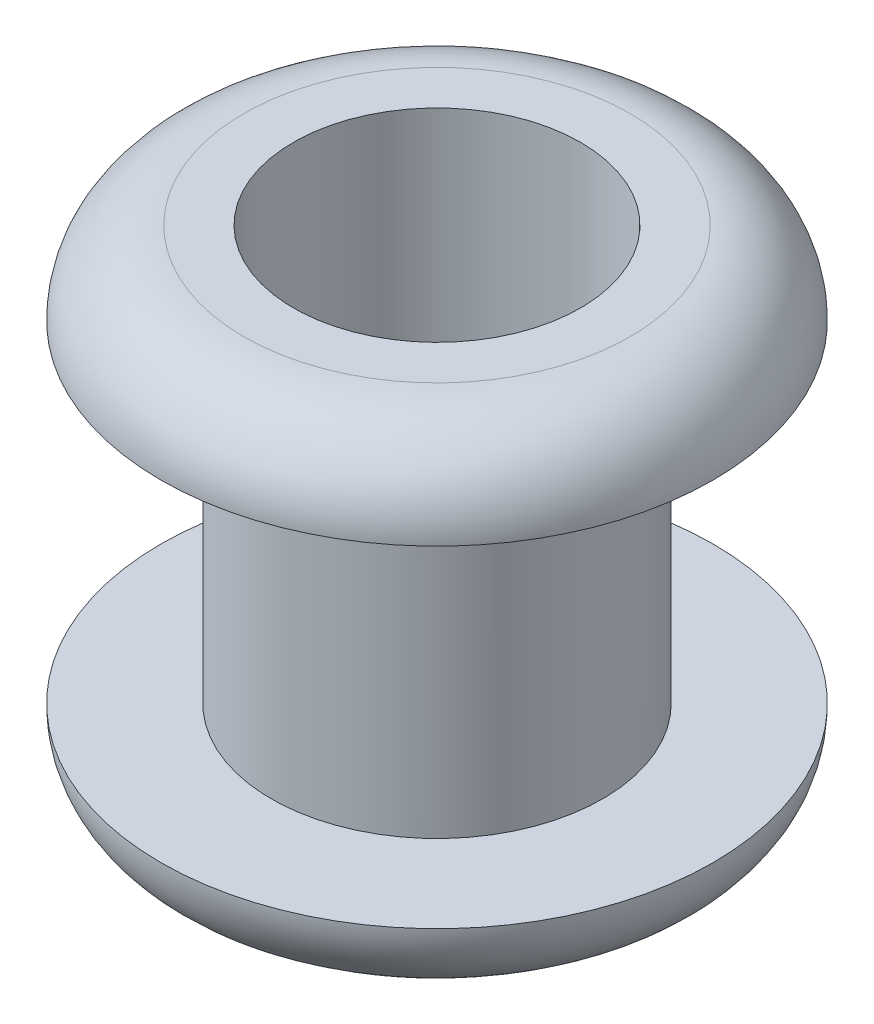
ISO-10303-21;
HEADER;
FILE_DESCRIPTION(('STEP AP214'),'2;1');
FILE_NAME('part.step','',(''),(''),'','','');
FILE_SCHEMA(('AUTOMOTIVE_DESIGN { 1 0 10303 214 1 1 1 1 }'));
ENDSEC;
DATA;
#1=APPLICATION_CONTEXT('core data for automotive mechanical design processes');
#2=APPLICATION_PROTOCOL_DEFINITION('international standard','automotive_design',2000,#1);
#3=PRODUCT_CONTEXT('',#1,'mechanical');
#4=PRODUCT('Part','Part','',(#3));
#5=PRODUCT_RELATED_PRODUCT_CATEGORY('part','',(#4));
#6=PRODUCT_DEFINITION_FORMATION('','',#4);
#7=PRODUCT_DEFINITION_CONTEXT('part definition',#1,'design');
#8=PRODUCT_DEFINITION('design','',#6,#7);
#9=PRODUCT_DEFINITION_SHAPE('','',#8);
#10=(LENGTH_UNIT() NAMED_UNIT(*) SI_UNIT(.MILLI.,.METRE.));
#11=(NAMED_UNIT(*) PLANE_ANGLE_UNIT() SI_UNIT($,.RADIAN.));
#12=(NAMED_UNIT(*) SI_UNIT($,.STERADIAN.) SOLID_ANGLE_UNIT());
#13=UNCERTAINTY_MEASURE_WITH_UNIT(LENGTH_MEASURE(1.E-05),#10,'distance_accuracy_value','');
#14=(GEOMETRIC_REPRESENTATION_CONTEXT(3) GLOBAL_UNCERTAINTY_ASSIGNED_CONTEXT((#13)) GLOBAL_UNIT_ASSIGNED_CONTEXT((#10,
#11,#12)) REPRESENTATION_CONTEXT('',''));
#15=CARTESIAN_POINT('',(0.,0.,0.));
#16=DIRECTION('',(0.,0.,1.));
#17=DIRECTION('',(1.,0.,0.));
#18=AXIS2_PLACEMENT_3D('',#15,#16,#17);
#19=CARTESIAN_POINT('',(0.,3.,0.));
#20=DIRECTION('',(0.,-1.,0.));
#21=DIRECTION('',(0.,0.,-1.));
#22=AXIS2_PLACEMENT_3D('',#19,#20,#21);
#23=CYLINDRICAL_SURFACE('',#22,1.5);
#24=CARTESIAN_POINT('',(0.,3.,0.));
#25=DIRECTION('',(0.,1.,0.));
#26=DIRECTION('',(0.,0.,1.));
#27=AXIS2_PLACEMENT_3D('',#24,#25,#26);
#28=CIRCLE('',#27,1.5);
#29=CARTESIAN_POINT('',(0.,3.,1.5));
#30=VERTEX_POINT('',#29);
#31=EDGE_CURVE('E38',#30,#30,#28,.T.);
#32=ORIENTED_EDGE('',*,*,#31,.F.);
#33=EDGE_LOOP('',(#32));
#34=FACE_BOUND('',#33,.T.);
#35=CARTESIAN_POINT('',(0.,0.,0.));
#36=DIRECTION('',(0.,-1.,0.));
#37=DIRECTION('',(0.,0.,-1.));
#38=AXIS2_PLACEMENT_3D('',#35,#36,#37);
#39=CIRCLE('',#38,1.5);
#40=CARTESIAN_POINT('',(0.,0.,-1.5));
#41=VERTEX_POINT('',#40);
#42=EDGE_CURVE('E47',#41,#41,#39,.T.);
#43=ORIENTED_EDGE('',*,*,#42,.F.);
#44=EDGE_LOOP('',(#43));
#45=FACE_BOUND('',#44,.T.);
#46=ADVANCED_FACE('F28',(#34,#45),#23,.T.);
#47=CARTESIAN_POINT('',(0.,3.,0.));
#48=DIRECTION('',(0.,1.,0.));
#49=DIRECTION('',(0.,0.,1.));
#50=AXIS2_PLACEMENT_3D('',#47,#48,#49);
#51=PLANE('',#50);
#52=CARTESIAN_POINT('',(0.,3.,0.));
#53=DIRECTION('',(0.,1.,0.));
#54=DIRECTION('',(0.,0.,1.));
#55=AXIS2_PLACEMENT_3D('',#52,#53,#54);
#56=CIRCLE('',#55,2.5);
#57=CARTESIAN_POINT('',(0.,3.,2.5));
#58=VERTEX_POINT('',#57);
#59=EDGE_CURVE('E42',#58,#58,#56,.T.);
#60=ORIENTED_EDGE('',*,*,#59,.F.);
#61=EDGE_LOOP('',(#60));
#62=FACE_BOUND('',#61,.T.);
#63=ORIENTED_EDGE('',*,*,#31,.T.);
#64=EDGE_LOOP('',(#63));
#65=FACE_BOUND('',#64,.T.);
#66=ADVANCED_FACE('F78',(#62,#65),#51,.F.);
#67=CARTESIAN_POINT('',(0.,3.75,0.));
#68=DIRECTION('',(0.,1.,0.));
#69=DIRECTION('',(0.,0.,1.));
#70=AXIS2_PLACEMENT_3D('',#67,#68,#69);
#71=PLANE('',#70);
#72=CARTESIAN_POINT('',(0.,3.75,0.));
#73=DIRECTION('',(0.,1.,0.));
#74=DIRECTION('',(0.,0.,1.));
#75=AXIS2_PLACEMENT_3D('',#72,#73,#74);
#76=CIRCLE('',#75,1.75);
#77=CARTESIAN_POINT('',(0.,3.75,1.75));
#78=VERTEX_POINT('',#77);
#79=EDGE_CURVE('E10',#78,#78,#76,.T.);
#80=ORIENTED_EDGE('',*,*,#79,.T.);
#81=EDGE_LOOP('',(#80));
#82=FACE_BOUND('',#81,.T.);
#83=CARTESIAN_POINT('',(0.,3.75,0.));
#84=DIRECTION('',(0.,-1.,0.));
#85=DIRECTION('',(0.,0.,-1.));
#86=AXIS2_PLACEMENT_3D('',#83,#84,#85);
#87=CIRCLE('',#86,1.3);
#88=CARTESIAN_POINT('',(0.,3.75,-1.3));
#89=VERTEX_POINT('',#88);
#90=EDGE_CURVE('E53',#89,#89,#87,.T.);
#91=ORIENTED_EDGE('',*,*,#90,.T.);
#92=EDGE_LOOP('',(#91));
#93=FACE_BOUND('',#92,.T.);
#94=ADVANCED_FACE('F73',(#82,#93),#71,.T.);
#95=CARTESIAN_POINT('',(0.,0.,0.));
#96=DIRECTION('',(0.,-1.,0.));
#97=DIRECTION('',(0.,0.,-1.));
#98=AXIS2_PLACEMENT_3D('',#95,#96,#97);
#99=PLANE('',#98);
#100=CARTESIAN_POINT('',(0.,0.,0.));
#101=DIRECTION('',(0.,-1.,0.));
#102=DIRECTION('',(0.,0.,-1.));
#103=AXIS2_PLACEMENT_3D('',#100,#101,#102);
#104=CIRCLE('',#103,2.5);
#105=CARTESIAN_POINT('',(0.,0.,-2.5));
#106=VERTEX_POINT('',#105);
#107=EDGE_CURVE('E50',#106,#106,#104,.T.);
#108=ORIENTED_EDGE('',*,*,#107,.F.);
#109=EDGE_LOOP('',(#108));
#110=FACE_BOUND('',#109,.T.);
#111=ORIENTED_EDGE('',*,*,#42,.T.);
#112=EDGE_LOOP('',(#111));
#113=FACE_BOUND('',#112,.T.);
#114=ADVANCED_FACE('F64',(#110,#113),#99,.F.);
#115=CARTESIAN_POINT('',(0.,-0.75,0.));
#116=DIRECTION('',(0.,-1.,0.));
#117=DIRECTION('',(0.,0.,-1.));
#118=AXIS2_PLACEMENT_3D('',#115,#116,#117);
#119=PLANE('',#118);
#120=CARTESIAN_POINT('',(0.,-0.75,0.));
#121=DIRECTION('',(0.,-1.,0.));
#122=DIRECTION('',(0.,0.,-1.));
#123=AXIS2_PLACEMENT_3D('',#120,#121,#122);
#124=CIRCLE('',#123,1.75);
#125=CARTESIAN_POINT('',(0.,-0.75,-1.75));
#126=VERTEX_POINT('',#125);
#127=EDGE_CURVE('E34',#126,#126,#124,.T.);
#128=ORIENTED_EDGE('',*,*,#127,.T.);
#129=EDGE_LOOP('',(#128));
#130=FACE_BOUND('',#129,.T.);
#131=CARTESIAN_POINT('',(0.,-0.75,0.));
#132=DIRECTION('',(0.,-1.,0.));
#133=DIRECTION('',(0.,0.,-1.));
#134=AXIS2_PLACEMENT_3D('',#131,#132,#133);
#135=CIRCLE('',#134,1.3);
#136=CARTESIAN_POINT('',(0.,-0.75,-1.3));
#137=VERTEX_POINT('',#136);
#138=EDGE_CURVE('E56',#137,#137,#135,.T.);
#139=ORIENTED_EDGE('',*,*,#138,.F.);
#140=EDGE_LOOP('',(#139));
#141=FACE_BOUND('',#140,.T.);
#142=ADVANCED_FACE('F62',(#130,#141),#119,.T.);
#143=CARTESIAN_POINT('',(0.,3.75,0.));
#144=DIRECTION('',(0.,-1.,0.));
#145=DIRECTION('',(0.,0.,-1.));
#146=AXIS2_PLACEMENT_3D('',#143,#144,#145);
#147=CYLINDRICAL_SURFACE('',#146,1.3);
#148=ORIENTED_EDGE('',*,*,#90,.F.);
#149=EDGE_LOOP('',(#148));
#150=FACE_BOUND('',#149,.T.);
#151=ORIENTED_EDGE('',*,*,#138,.T.);
#152=EDGE_LOOP('',(#151));
#153=FACE_BOUND('',#152,.T.);
#154=ADVANCED_FACE('F60',(#150,#153),#147,.F.);
#155=CARTESIAN_POINT('',(0.,0.,0.));
#156=DIRECTION('',(0.,-1.,0.));
#157=DIRECTION('',(0.,0.,-1.));
#158=AXIS2_PLACEMENT_3D('',#155,#156,#157);
#159=TOROIDAL_SURFACE('',#158,1.75,0.75);
#160=ORIENTED_EDGE('',*,*,#107,.T.);
#161=EDGE_LOOP('',(#160));
#162=FACE_BOUND('',#161,.T.);
#163=ORIENTED_EDGE('',*,*,#127,.F.);
#164=EDGE_LOOP('',(#163));
#165=FACE_BOUND('',#164,.T.);
#166=ADVANCED_FACE('F70',(#162,#165),#159,.T.);
#167=CARTESIAN_POINT('',(0.,3.,0.));
#168=DIRECTION('',(0.,1.,0.));
#169=DIRECTION('',(0.,0.,1.));
#170=AXIS2_PLACEMENT_3D('',#167,#168,#169);
#171=TOROIDAL_SURFACE('',#170,1.75,0.75);
#172=ORIENTED_EDGE('',*,*,#59,.T.);
#173=EDGE_LOOP('',(#172));
#174=FACE_BOUND('',#173,.T.);
#175=ORIENTED_EDGE('',*,*,#79,.F.);
#176=EDGE_LOOP('',(#175));
#177=FACE_BOUND('',#176,.T.);
#178=ADVANCED_FACE('F94',(#174,#177),#171,.T.);
#179=CLOSED_SHELL('',(#46,#66,#94,#114,#142,#154,#166,#178));
#180=MANIFOLD_SOLID_BREP('B2',#179);
#181=ADVANCED_BREP_SHAPE_REPRESENTATION('',(#18,#180),#14);
#182=SHAPE_DEFINITION_REPRESENTATION(#9,#181);
ENDSEC;
END-ISO-10303-21;
